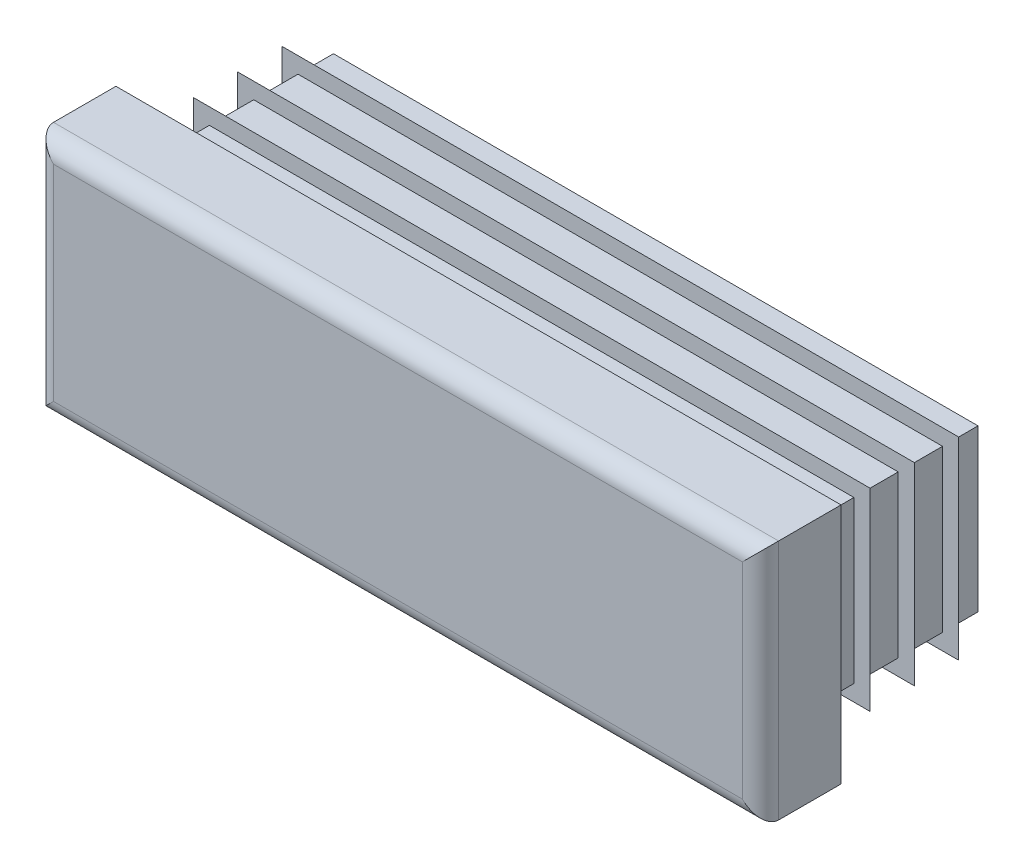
ISO-10303-21;
HEADER;
FILE_DESCRIPTION(('STEP AP214'),'2;1');
FILE_NAME('part.step','',(''),(''),'','','');
FILE_SCHEMA(('AUTOMOTIVE_DESIGN { 1 0 10303 214 1 1 1 1 }'));
ENDSEC;
DATA;
#1=APPLICATION_CONTEXT('core data for automotive mechanical design processes');
#2=APPLICATION_PROTOCOL_DEFINITION('international standard','automotive_design',2000,#1);
#3=PRODUCT_CONTEXT('',#1,'mechanical');
#4=PRODUCT('Part','Part','',(#3));
#5=PRODUCT_RELATED_PRODUCT_CATEGORY('part','',(#4));
#6=PRODUCT_DEFINITION_FORMATION('','',#4);
#7=PRODUCT_DEFINITION_CONTEXT('part definition',#1,'design');
#8=PRODUCT_DEFINITION('design','',#6,#7);
#9=PRODUCT_DEFINITION_SHAPE('','',#8);
#10=(LENGTH_UNIT() NAMED_UNIT(*) SI_UNIT(.MILLI.,.METRE.));
#11=(NAMED_UNIT(*) PLANE_ANGLE_UNIT() SI_UNIT($,.RADIAN.));
#12=(NAMED_UNIT(*) SI_UNIT($,.STERADIAN.) SOLID_ANGLE_UNIT());
#13=UNCERTAINTY_MEASURE_WITH_UNIT(LENGTH_MEASURE(1.E-05),#10,'distance_accuracy_value','');
#14=(GEOMETRIC_REPRESENTATION_CONTEXT(3) GLOBAL_UNCERTAINTY_ASSIGNED_CONTEXT((#13)) GLOBAL_UNIT_ASSIGNED_CONTEXT((#10,
#11,#12)) REPRESENTATION_CONTEXT('',''));
#15=CARTESIAN_POINT('',(0.,0.,0.));
#16=DIRECTION('',(0.,0.,1.));
#17=DIRECTION('',(1.,0.,0.));
#18=AXIS2_PLACEMENT_3D('',#15,#16,#17);
#19=CARTESIAN_POINT('',(21.375,-7.5,5.));
#20=DIRECTION('',(0.,0.,-1.));
#21=DIRECTION('',(0.,1.,0.));
#22=AXIS2_PLACEMENT_3D('',#19,#20,#21);
#23=PLANE('',#22);
#24=DIRECTION('',(0.,1.,0.));
#25=VECTOR('',#24,1.);
#26=CARTESIAN_POINT('',(-21.375,-7.5,5.));
#27=LINE('',#26,#25);
#28=CARTESIAN_POINT('',(-21.375,-6.375,5.));
#29=VERTEX_POINT('',#28);
#30=CARTESIAN_POINT('',(-21.375,6.375,5.));
#31=VERTEX_POINT('',#30);
#32=EDGE_CURVE('E310',#29,#31,#27,.T.);
#33=ORIENTED_EDGE('',*,*,#32,.F.);
#34=DIRECTION('',(-1.,0.,0.));
#35=VECTOR('',#34,1.);
#36=CARTESIAN_POINT('',(22.5,-6.375,5.));
#37=LINE('',#36,#35);
#38=CARTESIAN_POINT('',(21.375,-6.375,5.));
#39=VERTEX_POINT('',#38);
#40=EDGE_CURVE('E482',#39,#29,#37,.T.);
#41=ORIENTED_EDGE('',*,*,#40,.F.);
#42=DIRECTION('',(0.,1.,0.));
#43=VECTOR('',#42,1.);
#44=CARTESIAN_POINT('',(21.375,-7.5,5.));
#45=LINE('',#44,#43);
#46=CARTESIAN_POINT('',(21.375,6.375,5.));
#47=VERTEX_POINT('',#46);
#48=EDGE_CURVE('E305',#39,#47,#45,.T.);
#49=ORIENTED_EDGE('',*,*,#48,.T.);
#50=DIRECTION('',(-1.,0.,0.));
#51=VECTOR('',#50,1.);
#52=CARTESIAN_POINT('',(22.5,6.375,5.));
#53=LINE('',#52,#51);
#54=EDGE_CURVE('E630',#47,#31,#53,.T.);
#55=ORIENTED_EDGE('',*,*,#54,.T.);
#56=EDGE_LOOP('',(#33,#41,#49,#55));
#57=FACE_BOUND('',#56,.T.);
#58=ADVANCED_FACE('F14',(#57),#23,.F.);
#59=CARTESIAN_POINT('',(-21.375,-7.5,3.875));
#60=DIRECTION('',(0.,1.,0.));
#61=DIRECTION('',(-1.,0.,0.));
#62=AXIS2_PLACEMENT_3D('',#59,#60,#61);
#63=CYLINDRICAL_SURFACE('',#62,1.125);
#64=DIRECTION('',(0.,1.,0.));
#65=VECTOR('',#64,1.);
#66=CARTESIAN_POINT('',(-22.5,-7.5,3.875));
#67=LINE('',#66,#65);
#68=CARTESIAN_POINT('',(-22.5,-7.5,3.875));
#69=VERTEX_POINT('',#68);
#70=CARTESIAN_POINT('',(-22.5,7.5,3.875));
#71=VERTEX_POINT('',#70);
#72=EDGE_CURVE('E402',#69,#71,#67,.T.);
#73=ORIENTED_EDGE('',*,*,#72,.F.);
#74=CARTESIAN_POINT('',(-21.375,-6.375,3.875));
#75=DIRECTION('',(-0.707106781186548,0.707106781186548,0.));
#76=DIRECTION('',(0.707106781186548,0.707106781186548,0.));
#77=AXIS2_PLACEMENT_3D('',#74,#75,#76);
#78=ELLIPSE('',#77,1.59099025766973,1.125);
#79=EDGE_CURVE('E59',#69,#29,#78,.T.);
#80=ORIENTED_EDGE('',*,*,#79,.T.);
#81=ORIENTED_EDGE('',*,*,#32,.T.);
#82=CARTESIAN_POINT('',(-21.375,6.375,3.875));
#83=DIRECTION('',(0.707106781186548,0.707106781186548,0.));
#84=DIRECTION('',(-0.707106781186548,0.707106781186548,0.));
#85=AXIS2_PLACEMENT_3D('',#82,#83,#84);
#86=ELLIPSE('',#85,1.59099025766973,1.125);
#87=EDGE_CURVE('E306',#31,#71,#86,.F.);
#88=ORIENTED_EDGE('',*,*,#87,.T.);
#89=EDGE_LOOP('',(#73,#80,#81,#88));
#90=FACE_BOUND('',#89,.T.);
#91=ADVANCED_FACE('F16',(#90),#63,.T.);
#92=CARTESIAN_POINT('',(-22.5,-7.5,3.875));
#93=DIRECTION('',(1.,0.,0.));
#94=DIRECTION('',(0.,1.,0.));
#95=AXIS2_PLACEMENT_3D('',#92,#93,#94);
#96=PLANE('',#95);
#97=DIRECTION('',(0.,0.,-1.));
#98=VECTOR('',#97,1.);
#99=CARTESIAN_POINT('',(-22.5,7.5,3.875));
#100=LINE('',#99,#98);
#101=CARTESIAN_POINT('',(-22.5,7.5,0.));
#102=VERTEX_POINT('',#101);
#103=EDGE_CURVE('E615',#71,#102,#100,.T.);
#104=ORIENTED_EDGE('',*,*,#103,.T.);
#105=DIRECTION('',(0.,1.,0.));
#106=VECTOR('',#105,1.);
#107=CARTESIAN_POINT('',(-22.5,-7.5,0.));
#108=LINE('',#107,#106);
#109=CARTESIAN_POINT('',(-22.5,-7.5,0.));
#110=VERTEX_POINT('',#109);
#111=EDGE_CURVE('E400',#110,#102,#108,.T.);
#112=ORIENTED_EDGE('',*,*,#111,.F.);
#113=DIRECTION('',(0.,0.,-1.));
#114=VECTOR('',#113,1.);
#115=CARTESIAN_POINT('',(-22.5,-7.5,3.875));
#116=LINE('',#115,#114);
#117=EDGE_CURVE('E616',#69,#110,#116,.T.);
#118=ORIENTED_EDGE('',*,*,#117,.F.);
#119=ORIENTED_EDGE('',*,*,#72,.T.);
#120=EDGE_LOOP('',(#104,#112,#118,#119));
#121=FACE_BOUND('',#120,.T.);
#122=ADVANCED_FACE('F697',(#121),#96,.F.);
#123=CARTESIAN_POINT('',(-20.,-7.5,0.));
#124=DIRECTION('',(1.,0.,0.));
#125=DIRECTION('',(0.,1.,0.));
#126=AXIS2_PLACEMENT_3D('',#123,#124,#125);
#127=PLANE('',#126);
#128=DIRECTION('',(0.,1.,0.));
#129=VECTOR('',#128,1.);
#130=CARTESIAN_POINT('',(-20.,-7.5,0.));
#131=LINE('',#130,#129);
#132=CARTESIAN_POINT('',(-20.,-5.,0.));
#133=VERTEX_POINT('',#132);
#134=CARTESIAN_POINT('',(-20.,5.,0.));
#135=VERTEX_POINT('',#134);
#136=EDGE_CURVE('E397',#133,#135,#131,.T.);
#137=ORIENTED_EDGE('',*,*,#136,.T.);
#138=DIRECTION('',(0.,0.,-1.));
#139=VECTOR('',#138,1.);
#140=CARTESIAN_POINT('',(-20.,5.,0.));
#141=LINE('',#140,#139);
#142=CARTESIAN_POINT('',(-20.,5.,-0.55));
#143=VERTEX_POINT('',#142);
#144=EDGE_CURVE('E495',#135,#143,#141,.T.);
#145=ORIENTED_EDGE('',*,*,#144,.T.);
#146=DIRECTION('',(0.,1.,0.));
#147=VECTOR('',#146,1.);
#148=CARTESIAN_POINT('',(-20.,-7.5,-0.55));
#149=LINE('',#148,#147);
#150=CARTESIAN_POINT('',(-20.,-5.,-0.55));
#151=VERTEX_POINT('',#150);
#152=EDGE_CURVE('E394',#151,#143,#149,.T.);
#153=ORIENTED_EDGE('',*,*,#152,.F.);
#154=DIRECTION('',(0.,0.,1.));
#155=VECTOR('',#154,1.);
#156=CARTESIAN_POINT('',(-20.,-5.,0.));
#157=LINE('',#156,#155);
#158=EDGE_CURVE('E489',#151,#133,#157,.T.);
#159=ORIENTED_EDGE('',*,*,#158,.T.);
#160=EDGE_LOOP('',(#137,#145,#153,#159));
#161=FACE_BOUND('',#160,.T.);
#162=ADVANCED_FACE('F787',(#161),#127,.F.);
#163=CARTESIAN_POINT('',(-21.,-7.5,-0.55));
#164=DIRECTION('',(0.342020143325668,0.,0.939692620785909));
#165=DIRECTION('',(-0.939692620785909,0.,0.342020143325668));
#166=AXIS2_PLACEMENT_3D('',#163,#164,#165);
#167=PLANE('',#166);
#168=DIRECTION('',(0.,1.,0.));
#169=VECTOR('',#168,1.);
#170=CARTESIAN_POINT('',(-21.,-7.5,-0.55));
#171=LINE('',#170,#169);
#172=CARTESIAN_POINT('',(-21.,-6.,-0.55));
#173=VERTEX_POINT('',#172);
#174=CARTESIAN_POINT('',(-21.,6.,-0.550000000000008));
#175=VERTEX_POINT('',#174);
#176=EDGE_CURVE('E392',#173,#175,#171,.T.);
#177=ORIENTED_EDGE('',*,*,#176,.T.);
#178=DIRECTION('',(0.844349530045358,-0.43889572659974,-0.307318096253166));
#179=VECTOR('',#178,1.);
#180=CARTESIAN_POINT('',(-15.997151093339,3.39950230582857,-2.37088808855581));
#181=LINE('',#180,#179);
#182=CARTESIAN_POINT('',(-20.,5.48019663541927,-0.913970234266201));
#183=VERTEX_POINT('',#182);
#184=EDGE_CURVE('E519',#175,#183,#181,.T.);
#185=ORIENTED_EDGE('',*,*,#184,.T.);
#186=DIRECTION('',(0.,1.,0.));
#187=VECTOR('',#186,1.);
#188=CARTESIAN_POINT('',(-20.,-7.5,-0.913970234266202));
#189=LINE('',#188,#187);
#190=CARTESIAN_POINT('',(-20.,-5.48019663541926,-0.913970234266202));
#191=VERTEX_POINT('',#190);
#192=EDGE_CURVE('E389',#191,#183,#189,.T.);
#193=ORIENTED_EDGE('',*,*,#192,.F.);
#194=DIRECTION('',(-0.844349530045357,-0.43889572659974,0.307318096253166));
#195=VECTOR('',#194,1.);
#196=CARTESIAN_POINT('',(-21.5558721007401,-6.28894418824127,-0.347679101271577));
#197=LINE('',#196,#195);
#198=EDGE_CURVE('E507',#191,#173,#197,.T.);
#199=ORIENTED_EDGE('',*,*,#198,.T.);
#200=EDGE_LOOP('',(#177,#185,#193,#199));
#201=FACE_BOUND('',#200,.T.);
#202=ADVANCED_FACE('F783',(#201),#167,.F.);
#203=CARTESIAN_POINT('',(-20.,-7.5,-0.913970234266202));
#204=DIRECTION('',(1.,0.,0.));
#205=DIRECTION('',(0.,1.,0.));
#206=AXIS2_PLACEMENT_3D('',#203,#204,#205);
#207=PLANE('',#206);
#208=ORIENTED_EDGE('',*,*,#192,.T.);
#209=DIRECTION('',(0.,-0.819152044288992,-0.573576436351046));
#210=VECTOR('',#209,1.);
#211=CARTESIAN_POINT('',(-20.,-3.2296460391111,-7.01266773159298));
#212=LINE('',#211,#210);
#213=CARTESIAN_POINT('',(-20.,5.,-1.25020753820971));
#214=VERTEX_POINT('',#213);
#215=EDGE_CURVE('E516',#183,#214,#212,.T.);
#216=ORIENTED_EDGE('',*,*,#215,.T.);
#217=DIRECTION('',(0.,0.,-1.));
#218=VECTOR('',#217,1.);
#219=CARTESIAN_POINT('',(-20.,5.,-0.913970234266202));
#220=LINE('',#219,#218);
#221=CARTESIAN_POINT('',(-20.,5.,-3.3));
#222=VERTEX_POINT('',#221);
#223=EDGE_CURVE('E525',#214,#222,#220,.T.);
#224=ORIENTED_EDGE('',*,*,#223,.T.);
#225=DIRECTION('',(0.,1.,0.));
#226=VECTOR('',#225,1.);
#227=CARTESIAN_POINT('',(-20.,-7.5,-3.3));
#228=LINE('',#227,#226);
#229=CARTESIAN_POINT('',(-20.,-5.,-3.3));
#230=VERTEX_POINT('',#229);
#231=EDGE_CURVE('E386',#230,#222,#228,.T.);
#232=ORIENTED_EDGE('',*,*,#231,.F.);
#233=DIRECTION('',(0.,0.,1.));
#234=VECTOR('',#233,1.);
#235=CARTESIAN_POINT('',(-20.,-5.,-0.913970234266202));
#236=LINE('',#235,#234);
#237=CARTESIAN_POINT('',(-20.,-5.,-1.25020753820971));
#238=VERTEX_POINT('',#237);
#239=EDGE_CURVE('E522',#230,#238,#236,.T.);
#240=ORIENTED_EDGE('',*,*,#239,.T.);
#241=DIRECTION('',(0.,-0.819152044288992,0.573576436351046));
#242=VECTOR('',#241,1.);
#243=CARTESIAN_POINT('',(-20.,-6.83550503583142,0.0350269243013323));
#244=LINE('',#243,#242);
#245=EDGE_CURVE('E504',#238,#191,#244,.T.);
#246=ORIENTED_EDGE('',*,*,#245,.T.);
#247=EDGE_LOOP('',(#208,#216,#224,#232,#240,#246));
#248=FACE_BOUND('',#247,.T.);
#249=ADVANCED_FACE('F779',(#248),#207,.F.);
#250=CARTESIAN_POINT('',(-21.,-7.5,-3.3));
#251=DIRECTION('',(0.342020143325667,0.,0.939692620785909));
#252=DIRECTION('',(-0.939692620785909,0.,0.342020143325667));
#253=AXIS2_PLACEMENT_3D('',#250,#251,#252);
#254=PLANE('',#253);
#255=DIRECTION('',(0.,1.,0.));
#256=VECTOR('',#255,1.);
#257=CARTESIAN_POINT('',(-21.,-7.5,-3.3));
#258=LINE('',#257,#256);
#259=CARTESIAN_POINT('',(-21.,-6.,-3.3));
#260=VERTEX_POINT('',#259);
#261=CARTESIAN_POINT('',(-21.,6.,-3.3));
#262=VERTEX_POINT('',#261);
#263=EDGE_CURVE('E384',#260,#262,#258,.T.);
#264=ORIENTED_EDGE('',*,*,#263,.T.);
#265=DIRECTION('',(0.844349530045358,-0.43889572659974,-0.307318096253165));
#266=VECTOR('',#265,1.);
#267=CARTESIAN_POINT('',(-15.997151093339,3.39950230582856,-5.12088808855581));
#268=LINE('',#267,#266);
#269=CARTESIAN_POINT('',(-20.,5.48019663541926,-3.66397023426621));
#270=VERTEX_POINT('',#269);
#271=EDGE_CURVE('E549',#262,#270,#268,.T.);
#272=ORIENTED_EDGE('',*,*,#271,.T.);
#273=DIRECTION('',(0.,1.,0.));
#274=VECTOR('',#273,1.);
#275=CARTESIAN_POINT('',(-20.,-7.5,-3.66397023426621));
#276=LINE('',#275,#274);
#277=CARTESIAN_POINT('',(-20.,-5.48019663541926,-3.66397023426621));
#278=VERTEX_POINT('',#277);
#279=EDGE_CURVE('E381',#278,#270,#276,.T.);
#280=ORIENTED_EDGE('',*,*,#279,.F.);
#281=DIRECTION('',(-0.844349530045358,-0.43889572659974,0.307318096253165));
#282=VECTOR('',#281,1.);
#283=CARTESIAN_POINT('',(-21.5558721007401,-6.28894418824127,-3.09767910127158));
#284=LINE('',#283,#282);
#285=EDGE_CURVE('E537',#278,#260,#284,.T.);
#286=ORIENTED_EDGE('',*,*,#285,.T.);
#287=EDGE_LOOP('',(#264,#272,#280,#286));
#288=FACE_BOUND('',#287,.T.);
#289=ADVANCED_FACE('F775',(#288),#254,.F.);
#290=CARTESIAN_POINT('',(-20.,-7.5,-3.66397023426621));
#291=DIRECTION('',(1.,0.,0.));
#292=DIRECTION('',(0.,1.,0.));
#293=AXIS2_PLACEMENT_3D('',#290,#291,#292);
#294=PLANE('',#293);
#295=ORIENTED_EDGE('',*,*,#279,.T.);
#296=DIRECTION('',(0.,-0.819152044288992,-0.573576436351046));
#297=VECTOR('',#296,1.);
#298=CARTESIAN_POINT('',(-20.,-3.22964603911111,-9.76266773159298));
#299=LINE('',#298,#297);
#300=CARTESIAN_POINT('',(-20.,5.,-4.00020753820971));
#301=VERTEX_POINT('',#300);
#302=EDGE_CURVE('E546',#270,#301,#299,.T.);
#303=ORIENTED_EDGE('',*,*,#302,.T.);
#304=DIRECTION('',(0.,0.,-1.));
#305=VECTOR('',#304,1.);
#306=CARTESIAN_POINT('',(-20.,5.,-3.66397023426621));
#307=LINE('',#306,#305);
#308=CARTESIAN_POINT('',(-20.,5.,-6.05));
#309=VERTEX_POINT('',#308);
#310=EDGE_CURVE('E555',#301,#309,#307,.T.);
#311=ORIENTED_EDGE('',*,*,#310,.T.);
#312=DIRECTION('',(0.,1.,0.));
#313=VECTOR('',#312,1.);
#314=CARTESIAN_POINT('',(-20.,-7.5,-6.05));
#315=LINE('',#314,#313);
#316=CARTESIAN_POINT('',(-20.,-5.,-6.05));
#317=VERTEX_POINT('',#316);
#318=EDGE_CURVE('E378',#317,#309,#315,.T.);
#319=ORIENTED_EDGE('',*,*,#318,.F.);
#320=DIRECTION('',(0.,0.,1.));
#321=VECTOR('',#320,1.);
#322=CARTESIAN_POINT('',(-20.,-5.,-3.66397023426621));
#323=LINE('',#322,#321);
#324=CARTESIAN_POINT('',(-20.,-5.,-4.00020753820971));
#325=VERTEX_POINT('',#324);
#326=EDGE_CURVE('E552',#317,#325,#323,.T.);
#327=ORIENTED_EDGE('',*,*,#326,.T.);
#328=DIRECTION('',(0.,-0.819152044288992,0.573576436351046));
#329=VECTOR('',#328,1.);
#330=CARTESIAN_POINT('',(-20.,-6.83550503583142,-2.71497307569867));
#331=LINE('',#330,#329);
#332=EDGE_CURVE('E534',#325,#278,#331,.T.);
#333=ORIENTED_EDGE('',*,*,#332,.T.);
#334=EDGE_LOOP('',(#295,#303,#311,#319,#327,#333));
#335=FACE_BOUND('',#334,.T.);
#336=ADVANCED_FACE('F771',(#335),#294,.F.);
#337=CARTESIAN_POINT('',(-21.,-7.5,-6.05));
#338=DIRECTION('',(0.342020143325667,0.,0.939692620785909));
#339=DIRECTION('',(-0.939692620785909,0.,0.342020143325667));
#340=AXIS2_PLACEMENT_3D('',#337,#338,#339);
#341=PLANE('',#340);
#342=DIRECTION('',(0.,1.,0.));
#343=VECTOR('',#342,1.);
#344=CARTESIAN_POINT('',(-21.,-7.5,-6.05));
#345=LINE('',#344,#343);
#346=CARTESIAN_POINT('',(-21.,-6.,-6.05));
#347=VERTEX_POINT('',#346);
#348=CARTESIAN_POINT('',(-21.,6.,-6.05));
#349=VERTEX_POINT('',#348);
#350=EDGE_CURVE('E376',#347,#349,#345,.T.);
#351=ORIENTED_EDGE('',*,*,#350,.T.);
#352=DIRECTION('',(0.844349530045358,-0.43889572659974,-0.307318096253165));
#353=VECTOR('',#352,1.);
#354=CARTESIAN_POINT('',(-15.9971510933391,3.39950230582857,-7.87088808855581));
#355=LINE('',#354,#353);
#356=CARTESIAN_POINT('',(-20.,5.48019663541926,-6.4139702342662));
#357=VERTEX_POINT('',#356);
#358=EDGE_CURVE('E579',#349,#357,#355,.T.);
#359=ORIENTED_EDGE('',*,*,#358,.T.);
#360=DIRECTION('',(0.,1.,0.));
#361=VECTOR('',#360,1.);
#362=CARTESIAN_POINT('',(-20.,-7.5,-6.4139702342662));
#363=LINE('',#362,#361);
#364=CARTESIAN_POINT('',(-20.,-5.48019663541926,-6.4139702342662));
#365=VERTEX_POINT('',#364);
#366=EDGE_CURVE('E373',#365,#357,#363,.T.);
#367=ORIENTED_EDGE('',*,*,#366,.F.);
#368=DIRECTION('',(-0.844349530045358,-0.43889572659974,0.307318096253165));
#369=VECTOR('',#368,1.);
#370=CARTESIAN_POINT('',(-21.5558721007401,-6.28894418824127,-5.84767910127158));
#371=LINE('',#370,#369);
#372=EDGE_CURVE('E567',#365,#347,#371,.T.);
#373=ORIENTED_EDGE('',*,*,#372,.T.);
#374=EDGE_LOOP('',(#351,#359,#367,#373));
#375=FACE_BOUND('',#374,.T.);
#376=ADVANCED_FACE('F767',(#375),#341,.F.);
#377=CARTESIAN_POINT('',(-20.,-7.5,-6.4139702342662));
#378=DIRECTION('',(1.,0.,0.));
#379=DIRECTION('',(0.,1.,0.));
#380=AXIS2_PLACEMENT_3D('',#377,#378,#379);
#381=PLANE('',#380);
#382=ORIENTED_EDGE('',*,*,#366,.T.);
#383=DIRECTION('',(0.,-0.819152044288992,-0.573576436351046));
#384=VECTOR('',#383,1.);
#385=CARTESIAN_POINT('',(-20.,-3.2296460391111,-12.512667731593));
#386=LINE('',#385,#384);
#387=CARTESIAN_POINT('',(-20.,5.,-6.75020753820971));
#388=VERTEX_POINT('',#387);
#389=EDGE_CURVE('E576',#357,#388,#386,.T.);
#390=ORIENTED_EDGE('',*,*,#389,.T.);
#391=DIRECTION('',(0.,0.,-1.));
#392=VECTOR('',#391,1.);
#393=CARTESIAN_POINT('',(-20.,5.,-6.4139702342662));
#394=LINE('',#393,#392);
#395=CARTESIAN_POINT('',(-20.,5.,-8.8));
#396=VERTEX_POINT('',#395);
#397=EDGE_CURVE('E585',#388,#396,#394,.T.);
#398=ORIENTED_EDGE('',*,*,#397,.T.);
#399=DIRECTION('',(0.,1.,0.));
#400=VECTOR('',#399,1.);
#401=CARTESIAN_POINT('',(-20.,-7.5,-8.8));
#402=LINE('',#401,#400);
#403=CARTESIAN_POINT('',(-20.,-5.,-8.8));
#404=VERTEX_POINT('',#403);
#405=EDGE_CURVE('E370',#404,#396,#402,.T.);
#406=ORIENTED_EDGE('',*,*,#405,.F.);
#407=DIRECTION('',(0.,0.,1.));
#408=VECTOR('',#407,1.);
#409=CARTESIAN_POINT('',(-20.,-5.,-6.4139702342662));
#410=LINE('',#409,#408);
#411=CARTESIAN_POINT('',(-20.,-5.,-6.75020753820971));
#412=VERTEX_POINT('',#411);
#413=EDGE_CURVE('E582',#404,#412,#410,.T.);
#414=ORIENTED_EDGE('',*,*,#413,.T.);
#415=DIRECTION('',(0.,-0.819152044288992,0.573576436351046));
#416=VECTOR('',#415,1.);
#417=CARTESIAN_POINT('',(-20.,-6.83550503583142,-5.46497307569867));
#418=LINE('',#417,#416);
#419=EDGE_CURVE('E564',#412,#365,#418,.T.);
#420=ORIENTED_EDGE('',*,*,#419,.T.);
#421=EDGE_LOOP('',(#382,#390,#398,#406,#414,#420));
#422=FACE_BOUND('',#421,.T.);
#423=ADVANCED_FACE('F764',(#422),#381,.F.);
#424=CARTESIAN_POINT('',(-21.,-7.5,-8.8));
#425=DIRECTION('',(0.342020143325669,0.,0.939692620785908));
#426=DIRECTION('',(-0.939692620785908,0.,0.342020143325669));
#427=AXIS2_PLACEMENT_3D('',#424,#425,#426);
#428=PLANE('',#427);
#429=DIRECTION('',(0.,1.,0.));
#430=VECTOR('',#429,1.);
#431=CARTESIAN_POINT('',(-21.,-7.5,-8.8));
#432=LINE('',#431,#430);
#433=CARTESIAN_POINT('',(-21.,-6.,-8.8));
#434=VERTEX_POINT('',#433);
#435=CARTESIAN_POINT('',(-21.,6.,-8.8));
#436=VERTEX_POINT('',#435);
#437=EDGE_CURVE('E368',#434,#436,#432,.T.);
#438=ORIENTED_EDGE('',*,*,#437,.T.);
#439=DIRECTION('',(0.844349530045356,-0.438895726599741,-0.307318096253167));
#440=VECTOR('',#439,1.);
#441=CARTESIAN_POINT('',(-15.997151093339,3.39950230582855,-10.6208880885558));
#442=LINE('',#441,#440);
#443=CARTESIAN_POINT('',(-20.,5.48019663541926,-9.1639702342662));
#444=VERTEX_POINT('',#443);
#445=EDGE_CURVE('E607',#436,#444,#442,.T.);
#446=ORIENTED_EDGE('',*,*,#445,.T.);
#447=DIRECTION('',(0.,1.,0.));
#448=VECTOR('',#447,1.);
#449=CARTESIAN_POINT('',(-20.,-7.5,-9.1639702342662));
#450=LINE('',#449,#448);
#451=CARTESIAN_POINT('',(-20.,-5.48019663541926,-9.1639702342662));
#452=VERTEX_POINT('',#451);
#453=EDGE_CURVE('E365',#452,#444,#450,.T.);
#454=ORIENTED_EDGE('',*,*,#453,.F.);
#455=DIRECTION('',(-0.844349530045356,-0.438895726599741,0.307318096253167));
#456=VECTOR('',#455,1.);
#457=CARTESIAN_POINT('',(-21.5558721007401,-6.28894418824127,-8.59767910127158));
#458=LINE('',#457,#456);
#459=EDGE_CURVE('E595',#452,#434,#458,.T.);
#460=ORIENTED_EDGE('',*,*,#459,.T.);
#461=EDGE_LOOP('',(#438,#446,#454,#460));
#462=FACE_BOUND('',#461,.T.);
#463=ADVANCED_FACE('F675',(#462),#428,.F.);
#464=CARTESIAN_POINT('',(-20.,-7.5,-9.1639702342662));
#465=DIRECTION('',(1.,0.,0.));
#466=DIRECTION('',(0.,1.,0.));
#467=AXIS2_PLACEMENT_3D('',#464,#465,#466);
#468=PLANE('',#467);
#469=ORIENTED_EDGE('',*,*,#453,.T.);
#470=DIRECTION('',(0.,-0.819152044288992,-0.573576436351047));
#471=VECTOR('',#470,1.);
#472=CARTESIAN_POINT('',(-20.,-3.22964603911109,-15.262667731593));
#473=LINE('',#472,#471);
#474=CARTESIAN_POINT('',(-20.,5.,-9.50020753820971));
#475=VERTEX_POINT('',#474);
#476=EDGE_CURVE('E604',#444,#475,#473,.T.);
#477=ORIENTED_EDGE('',*,*,#476,.T.);
#478=DIRECTION('',(0.,0.,-1.));
#479=VECTOR('',#478,1.);
#480=CARTESIAN_POINT('',(-20.,5.,-9.1639702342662));
#481=LINE('',#480,#479);
#482=CARTESIAN_POINT('',(-20.,5.,-11.));
#483=VERTEX_POINT('',#482);
#484=EDGE_CURVE('E613',#475,#483,#481,.T.);
#485=ORIENTED_EDGE('',*,*,#484,.T.);
#486=DIRECTION('',(0.,1.,0.));
#487=VECTOR('',#486,1.);
#488=CARTESIAN_POINT('',(-20.,-7.5,-11.));
#489=LINE('',#488,#487);
#490=CARTESIAN_POINT('',(-20.,-5.,-11.));
#491=VERTEX_POINT('',#490);
#492=EDGE_CURVE('E362',#491,#483,#489,.T.);
#493=ORIENTED_EDGE('',*,*,#492,.F.);
#494=DIRECTION('',(0.,0.,1.));
#495=VECTOR('',#494,1.);
#496=CARTESIAN_POINT('',(-20.,-5.,-9.1639702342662));
#497=LINE('',#496,#495);
#498=CARTESIAN_POINT('',(-20.,-5.,-9.50020753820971));
#499=VERTEX_POINT('',#498);
#500=EDGE_CURVE('E610',#491,#499,#497,.T.);
#501=ORIENTED_EDGE('',*,*,#500,.T.);
#502=DIRECTION('',(0.,-0.819152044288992,0.573576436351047));
#503=VECTOR('',#502,1.);
#504=CARTESIAN_POINT('',(-20.,-6.83550503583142,-8.21497307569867));
#505=LINE('',#504,#503);
#506=EDGE_CURVE('E592',#499,#452,#505,.T.);
#507=ORIENTED_EDGE('',*,*,#506,.T.);
#508=EDGE_LOOP('',(#469,#477,#485,#493,#501,#507));
#509=FACE_BOUND('',#508,.T.);
#510=ADVANCED_FACE('F677',(#509),#468,.F.);
#511=CARTESIAN_POINT('',(-20.,-7.5,-11.));
#512=DIRECTION('',(0.,0.,1.));
#513=DIRECTION('',(0.,-1.,0.));
#514=AXIS2_PLACEMENT_3D('',#511,#512,#513);
#515=PLANE('',#514);
#516=ORIENTED_EDGE('',*,*,#492,.T.);
#517=DIRECTION('',(-1.,0.,0.));
#518=VECTOR('',#517,1.);
#519=CARTESIAN_POINT('',(22.5,5.,-11.));
#520=LINE('',#519,#518);
#521=CARTESIAN_POINT('',(20.,5.,-11.));
#522=VERTEX_POINT('',#521);
#523=EDGE_CURVE('E438',#522,#483,#520,.T.);
#524=ORIENTED_EDGE('',*,*,#523,.F.);
#525=DIRECTION('',(0.,1.,0.));
#526=VECTOR('',#525,1.);
#527=CARTESIAN_POINT('',(20.,-7.5,-11.));
#528=LINE('',#527,#526);
#529=CARTESIAN_POINT('',(20.,-5.,-11.));
#530=VERTEX_POINT('',#529);
#531=EDGE_CURVE('E359',#530,#522,#528,.T.);
#532=ORIENTED_EDGE('',*,*,#531,.F.);
#533=DIRECTION('',(-1.,0.,0.));
#534=VECTOR('',#533,1.);
#535=CARTESIAN_POINT('',(22.5,-5.,-11.));
#536=LINE('',#535,#534);
#537=EDGE_CURVE('E436',#530,#491,#536,.T.);
#538=ORIENTED_EDGE('',*,*,#537,.T.);
#539=EDGE_LOOP('',(#516,#524,#532,#538));
#540=FACE_BOUND('',#539,.T.);
#541=ADVANCED_FACE('F435',(#540),#515,.F.);
#542=CARTESIAN_POINT('',(20.,-7.5,-11.));
#543=DIRECTION('',(-1.,0.,0.));
#544=DIRECTION('',(0.,-1.,0.));
#545=AXIS2_PLACEMENT_3D('',#542,#543,#544);
#546=PLANE('',#545);
#547=DIRECTION('',(0.,0.,1.));
#548=VECTOR('',#547,1.);
#549=CARTESIAN_POINT('',(20.,5.,-11.));
#550=LINE('',#549,#548);
#551=CARTESIAN_POINT('',(20.,5.,-9.50020753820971));
#552=VERTEX_POINT('',#551);
#553=EDGE_CURVE('E9',#522,#552,#550,.T.);
#554=ORIENTED_EDGE('',*,*,#553,.T.);
#555=DIRECTION('',(0.,0.819152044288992,0.573576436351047));
#556=VECTOR('',#555,1.);
#557=CARTESIAN_POINT('',(20.,-4.09229785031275,-15.8667030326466));
#558=LINE('',#557,#556);
#559=CARTESIAN_POINT('',(20.,5.48019663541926,-9.1639702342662));
#560=VERTEX_POINT('',#559);
#561=EDGE_CURVE('E601',#552,#560,#558,.T.);
#562=ORIENTED_EDGE('',*,*,#561,.T.);
#563=DIRECTION('',(0.,1.,0.));
#564=VECTOR('',#563,1.);
#565=CARTESIAN_POINT('',(20.,-7.5,-9.1639702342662));
#566=LINE('',#565,#564);
#567=CARTESIAN_POINT('',(20.,-5.48019663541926,-9.1639702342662));
#568=VERTEX_POINT('',#567);
#569=EDGE_CURVE('E356',#568,#560,#566,.T.);
#570=ORIENTED_EDGE('',*,*,#569,.F.);
#571=DIRECTION('',(0.,0.819152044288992,-0.573576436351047));
#572=VECTOR('',#571,1.);
#573=CARTESIAN_POINT('',(20.,-5.97285322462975,-8.81900837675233));
#574=LINE('',#573,#572);
#575=CARTESIAN_POINT('',(20.,-5.,-9.50020753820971));
#576=VERTEX_POINT('',#575);
#577=EDGE_CURVE('E428',#568,#576,#574,.T.);
#578=ORIENTED_EDGE('',*,*,#577,.T.);
#579=DIRECTION('',(0.,0.,-1.));
#580=VECTOR('',#579,1.);
#581=CARTESIAN_POINT('',(20.,-5.,-11.));
#582=LINE('',#581,#580);
#583=EDGE_CURVE('E23',#576,#530,#582,.T.);
#584=ORIENTED_EDGE('',*,*,#583,.T.);
#585=ORIENTED_EDGE('',*,*,#531,.T.);
#586=EDGE_LOOP('',(#554,#562,#570,#578,#584,#585));
#587=FACE_BOUND('',#586,.T.);
#588=ADVANCED_FACE('F426',(#587),#546,.F.);
#589=CARTESIAN_POINT('',(20.,-7.5,-9.1639702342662));
#590=DIRECTION('',(-0.342020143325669,0.,0.939692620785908));
#591=DIRECTION('',(-0.939692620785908,0.,-0.342020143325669));
#592=AXIS2_PLACEMENT_3D('',#589,#590,#591);
#593=PLANE('',#592);
#594=ORIENTED_EDGE('',*,*,#569,.T.);
#595=DIRECTION('',(0.844349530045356,0.438895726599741,0.307318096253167));
#596=VECTOR('',#595,1.);
#597=CARTESIAN_POINT('',(15.1897805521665,2.97982838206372,-10.914746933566));
#598=LINE('',#597,#596);
#599=CARTESIAN_POINT('',(21.,6.,-8.8));
#600=VERTEX_POINT('',#599);
#601=EDGE_CURVE('E598',#560,#600,#598,.T.);
#602=ORIENTED_EDGE('',*,*,#601,.T.);
#603=DIRECTION('',(0.,1.,0.));
#604=VECTOR('',#603,1.);
#605=CARTESIAN_POINT('',(21.,-7.5,-8.8));
#606=LINE('',#605,#604);
#607=CARTESIAN_POINT('',(21.,-6.,-8.8));
#608=VERTEX_POINT('',#607);
#609=EDGE_CURVE('E353',#608,#600,#606,.T.);
#610=ORIENTED_EDGE('',*,*,#609,.F.);
#611=DIRECTION('',(-0.844349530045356,0.438895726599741,-0.307318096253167));
#612=VECTOR('',#611,1.);
#613=CARTESIAN_POINT('',(20.7485015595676,-5.86927026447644,-8.89153794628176));
#614=LINE('',#613,#612);
#615=EDGE_CURVE('E588',#608,#568,#614,.T.);
#616=ORIENTED_EDGE('',*,*,#615,.T.);
#617=EDGE_LOOP('',(#594,#602,#610,#616));
#618=FACE_BOUND('',#617,.T.);
#619=ADVANCED_FACE('F752',(#618),#593,.F.);
#620=CARTESIAN_POINT('',(21.,-7.5,-8.8));
#621=DIRECTION('',(0.,0.,-1.));
#622=DIRECTION('',(0.,1.,0.));
#623=AXIS2_PLACEMENT_3D('',#620,#621,#622);
#624=PLANE('',#623);
#625=ORIENTED_EDGE('',*,*,#609,.T.);
#626=DIRECTION('',(-1.,0.,0.));
#627=VECTOR('',#626,1.);
#628=CARTESIAN_POINT('',(22.5,6.,-8.8));
#629=LINE('',#628,#627);
#630=EDGE_CURVE('E444',#600,#436,#629,.T.);
#631=ORIENTED_EDGE('',*,*,#630,.T.);
#632=ORIENTED_EDGE('',*,*,#437,.F.);
#633=DIRECTION('',(-1.,0.,0.));
#634=VECTOR('',#633,1.);
#635=CARTESIAN_POINT('',(22.5,-6.,-8.8));
#636=LINE('',#635,#634);
#637=EDGE_CURVE('E451',#608,#434,#636,.T.);
#638=ORIENTED_EDGE('',*,*,#637,.F.);
#639=EDGE_LOOP('',(#625,#631,#632,#638));
#640=FACE_BOUND('',#639,.T.);
#641=ORIENTED_EDGE('',*,*,#405,.T.);
#642=DIRECTION('',(-1.,0.,0.));
#643=VECTOR('',#642,1.);
#644=CARTESIAN_POINT('',(22.5,5.,-8.8));
#645=LINE('',#644,#643);
#646=CARTESIAN_POINT('',(20.,5.,-8.8));
#647=VERTEX_POINT('',#646);
#648=EDGE_CURVE('E663',#647,#396,#645,.T.);
#649=ORIENTED_EDGE('',*,*,#648,.F.);
#650=DIRECTION('',(0.,1.,0.));
#651=VECTOR('',#650,1.);
#652=CARTESIAN_POINT('',(20.,-7.5,-8.8));
#653=LINE('',#652,#651);
#654=CARTESIAN_POINT('',(20.,-5.,-8.8));
#655=VERTEX_POINT('',#654);
#656=EDGE_CURVE('E350',#655,#647,#653,.T.);
#657=ORIENTED_EDGE('',*,*,#656,.F.);
#658=DIRECTION('',(-1.,0.,0.));
#659=VECTOR('',#658,1.);
#660=CARTESIAN_POINT('',(22.5,-5.,-8.8));
#661=LINE('',#660,#659);
#662=EDGE_CURVE('E453',#655,#404,#661,.T.);
#663=ORIENTED_EDGE('',*,*,#662,.T.);
#664=EDGE_LOOP('',(#641,#649,#657,#663));
#665=FACE_BOUND('',#664,.T.);
#666=ADVANCED_FACE('F667',(#640,#665),#624,.F.);
#667=CARTESIAN_POINT('',(20.,-7.5,-8.8));
#668=DIRECTION('',(-1.,0.,0.));
#669=DIRECTION('',(0.,-1.,0.));
#670=AXIS2_PLACEMENT_3D('',#667,#668,#669);
#671=PLANE('',#670);
#672=DIRECTION('',(0.,0.,1.));
#673=VECTOR('',#672,1.);
#674=CARTESIAN_POINT('',(20.,5.,-8.8));
#675=LINE('',#674,#673);
#676=CARTESIAN_POINT('',(20.,5.,-6.75020753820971));
#677=VERTEX_POINT('',#676);
#678=EDGE_CURVE('E420',#647,#677,#675,.T.);
#679=ORIENTED_EDGE('',*,*,#678,.T.);
#680=DIRECTION('',(0.,0.819152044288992,0.573576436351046));
#681=VECTOR('',#680,1.);
#682=CARTESIAN_POINT('',(20.,-4.35071332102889,-13.2976474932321));
#683=LINE('',#682,#681);
#684=CARTESIAN_POINT('',(20.,5.48019663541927,-6.4139702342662));
#685=VERTEX_POINT('',#684);
#686=EDGE_CURVE('E573',#677,#685,#683,.T.);
#687=ORIENTED_EDGE('',*,*,#686,.T.);
#688=DIRECTION('',(0.,1.,0.));
#689=VECTOR('',#688,1.);
#690=CARTESIAN_POINT('',(20.,-7.5,-6.4139702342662));
#691=LINE('',#690,#689);
#692=CARTESIAN_POINT('',(20.,-5.48019663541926,-6.4139702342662));
#693=VERTEX_POINT('',#692);
#694=EDGE_CURVE('E347',#693,#685,#691,.T.);
#695=ORIENTED_EDGE('',*,*,#694,.F.);
#696=DIRECTION('',(0.,0.819152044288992,-0.573576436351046));
#697=VECTOR('',#696,1.);
#698=CARTESIAN_POINT('',(20.,-5.71443775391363,-6.24995283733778));
#699=LINE('',#698,#697);
#700=CARTESIAN_POINT('',(20.,-5.,-6.75020753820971));
#701=VERTEX_POINT('',#700);
#702=EDGE_CURVE('E561',#693,#701,#699,.T.);
#703=ORIENTED_EDGE('',*,*,#702,.T.);
#704=DIRECTION('',(0.,0.,-1.));
#705=VECTOR('',#704,1.);
#706=CARTESIAN_POINT('',(20.,-5.,-8.8));
#707=LINE('',#706,#705);
#708=EDGE_CURVE('E417',#701,#655,#707,.T.);
#709=ORIENTED_EDGE('',*,*,#708,.T.);
#710=ORIENTED_EDGE('',*,*,#656,.T.);
#711=EDGE_LOOP('',(#679,#687,#695,#703,#709,#710));
#712=FACE_BOUND('',#711,.T.);
#713=ADVANCED_FACE('F745',(#712),#671,.F.);
#714=CARTESIAN_POINT('',(20.,-7.5,-6.4139702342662));
#715=DIRECTION('',(-0.342020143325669,0.,0.939692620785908));
#716=DIRECTION('',(-0.939692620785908,0.,-0.342020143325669));
#717=AXIS2_PLACEMENT_3D('',#714,#715,#716);
#718=PLANE('',#717);
#719=ORIENTED_EDGE('',*,*,#694,.T.);
#720=DIRECTION('',(0.844349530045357,0.438895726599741,0.307318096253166));
#721=VECTOR('',#720,1.);
#722=CARTESIAN_POINT('',(15.1897805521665,2.97982838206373,-8.164746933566));
#723=LINE('',#722,#721);
#724=CARTESIAN_POINT('',(21.,6.,-6.05));
#725=VERTEX_POINT('',#724);
#726=EDGE_CURVE('E570',#685,#725,#723,.T.);
#727=ORIENTED_EDGE('',*,*,#726,.T.);
#728=DIRECTION('',(0.,1.,0.));
#729=VECTOR('',#728,1.);
#730=CARTESIAN_POINT('',(21.,-7.5,-6.05));
#731=LINE('',#730,#729);
#732=CARTESIAN_POINT('',(21.,-6.,-6.05));
#733=VERTEX_POINT('',#732);
#734=EDGE_CURVE('E344',#733,#725,#731,.T.);
#735=ORIENTED_EDGE('',*,*,#734,.F.);
#736=DIRECTION('',(-0.844349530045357,0.438895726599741,-0.307318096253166));
#737=VECTOR('',#736,1.);
#738=CARTESIAN_POINT('',(20.7485015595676,-5.86927026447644,-6.14153794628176));
#739=LINE('',#738,#737);
#740=EDGE_CURVE('E558',#733,#693,#739,.T.);
#741=ORIENTED_EDGE('',*,*,#740,.T.);
#742=EDGE_LOOP('',(#719,#727,#735,#741));
#743=FACE_BOUND('',#742,.T.);
#744=ADVANCED_FACE('F741',(#743),#718,.F.);
#745=CARTESIAN_POINT('',(21.,-7.5,-6.05));
#746=DIRECTION('',(0.,0.,-1.));
#747=DIRECTION('',(0.,1.,0.));
#748=AXIS2_PLACEMENT_3D('',#745,#746,#747);
#749=PLANE('',#748);
#750=ORIENTED_EDGE('',*,*,#734,.T.);
#751=DIRECTION('',(-1.,0.,0.));
#752=VECTOR('',#751,1.);
#753=CARTESIAN_POINT('',(22.5,6.,-6.05));
#754=LINE('',#753,#752);
#755=EDGE_CURVE('E657',#725,#349,#754,.T.);
#756=ORIENTED_EDGE('',*,*,#755,.T.);
#757=ORIENTED_EDGE('',*,*,#350,.F.);
#758=DIRECTION('',(-1.,0.,0.));
#759=VECTOR('',#758,1.);
#760=CARTESIAN_POINT('',(22.5,-6.,-6.05));
#761=LINE('',#760,#759);
#762=EDGE_CURVE('E459',#733,#347,#761,.T.);
#763=ORIENTED_EDGE('',*,*,#762,.F.);
#764=EDGE_LOOP('',(#750,#756,#757,#763));
#765=FACE_BOUND('',#764,.T.);
#766=ORIENTED_EDGE('',*,*,#318,.T.);
#767=DIRECTION('',(-1.,0.,0.));
#768=VECTOR('',#767,1.);
#769=CARTESIAN_POINT('',(22.5,5.,-6.05));
#770=LINE('',#769,#768);
#771=CARTESIAN_POINT('',(20.,5.,-6.05));
#772=VERTEX_POINT('',#771);
#773=EDGE_CURVE('E655',#772,#309,#770,.T.);
#774=ORIENTED_EDGE('',*,*,#773,.F.);
#775=DIRECTION('',(0.,1.,0.));
#776=VECTOR('',#775,1.);
#777=CARTESIAN_POINT('',(20.,-7.5,-6.05));
#778=LINE('',#777,#776);
#779=CARTESIAN_POINT('',(20.,-5.,-6.05));
#780=VERTEX_POINT('',#779);
#781=EDGE_CURVE('E341',#780,#772,#778,.T.);
#782=ORIENTED_EDGE('',*,*,#781,.F.);
#783=DIRECTION('',(-1.,0.,0.));
#784=VECTOR('',#783,1.);
#785=CARTESIAN_POINT('',(22.5,-5.,-6.05));
#786=LINE('',#785,#784);
#787=EDGE_CURVE('E461',#780,#317,#786,.T.);
#788=ORIENTED_EDGE('',*,*,#787,.T.);
#789=EDGE_LOOP('',(#766,#774,#782,#788));
#790=FACE_BOUND('',#789,.T.);
#791=ADVANCED_FACE('F737',(#765,#790),#749,.F.);
#792=CARTESIAN_POINT('',(20.,-7.5,-6.05));
#793=DIRECTION('',(-1.,0.,0.));
#794=DIRECTION('',(0.,-1.,0.));
#795=AXIS2_PLACEMENT_3D('',#792,#793,#794);
#796=PLANE('',#795);
#797=DIRECTION('',(0.,0.,1.));
#798=VECTOR('',#797,1.);
#799=CARTESIAN_POINT('',(20.,5.,-6.05));
#800=LINE('',#799,#798);
#801=CARTESIAN_POINT('',(20.,5.,-4.00020753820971));
#802=VERTEX_POINT('',#801);
#803=EDGE_CURVE('E414',#772,#802,#800,.T.);
#804=ORIENTED_EDGE('',*,*,#803,.T.);
#805=DIRECTION('',(0.,0.819152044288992,0.573576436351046));
#806=VECTOR('',#805,1.);
#807=CARTESIAN_POINT('',(20.,-4.35071332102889,-10.5476474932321));
#808=LINE('',#807,#806);
#809=CARTESIAN_POINT('',(20.,5.48019663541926,-3.66397023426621));
#810=VERTEX_POINT('',#809);
#811=EDGE_CURVE('E543',#802,#810,#808,.T.);
#812=ORIENTED_EDGE('',*,*,#811,.T.);
#813=DIRECTION('',(0.,1.,0.));
#814=VECTOR('',#813,1.);
#815=CARTESIAN_POINT('',(20.,-7.5,-3.66397023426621));
#816=LINE('',#815,#814);
#817=CARTESIAN_POINT('',(20.,-5.48019663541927,-3.66397023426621));
#818=VERTEX_POINT('',#817);
#819=EDGE_CURVE('E338',#818,#810,#816,.T.);
#820=ORIENTED_EDGE('',*,*,#819,.F.);
#821=DIRECTION('',(0.,0.819152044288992,-0.573576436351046));
#822=VECTOR('',#821,1.);
#823=CARTESIAN_POINT('',(20.,-5.71443775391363,-3.49995283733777));
#824=LINE('',#823,#822);
#825=CARTESIAN_POINT('',(20.,-5.,-4.00020753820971));
#826=VERTEX_POINT('',#825);
#827=EDGE_CURVE('E531',#818,#826,#824,.T.);
#828=ORIENTED_EDGE('',*,*,#827,.T.);
#829=DIRECTION('',(0.,0.,-1.));
#830=VECTOR('',#829,1.);
#831=CARTESIAN_POINT('',(20.,-5.,-6.05));
#832=LINE('',#831,#830);
#833=EDGE_CURVE('E411',#826,#780,#832,.T.);
#834=ORIENTED_EDGE('',*,*,#833,.T.);
#835=ORIENTED_EDGE('',*,*,#781,.T.);
#836=EDGE_LOOP('',(#804,#812,#820,#828,#834,#835));
#837=FACE_BOUND('',#836,.T.);
#838=ADVANCED_FACE('F733',(#837),#796,.F.);
#839=CARTESIAN_POINT('',(20.,-7.5,-3.66397023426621));
#840=DIRECTION('',(-0.342020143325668,0.,0.939692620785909));
#841=DIRECTION('',(-0.939692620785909,0.,-0.342020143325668));
#842=AXIS2_PLACEMENT_3D('',#839,#840,#841);
#843=PLANE('',#842);
#844=ORIENTED_EDGE('',*,*,#819,.T.);
#845=DIRECTION('',(0.844349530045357,0.438895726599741,0.307318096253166));
#846=VECTOR('',#845,1.);
#847=CARTESIAN_POINT('',(15.1897805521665,2.97982838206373,-5.414746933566));
#848=LINE('',#847,#846);
#849=CARTESIAN_POINT('',(21.,6.,-3.3));
#850=VERTEX_POINT('',#849);
#851=EDGE_CURVE('E540',#810,#850,#848,.T.);
#852=ORIENTED_EDGE('',*,*,#851,.T.);
#853=DIRECTION('',(0.,1.,0.));
#854=VECTOR('',#853,1.);
#855=CARTESIAN_POINT('',(21.,-7.5,-3.3));
#856=LINE('',#855,#854);
#857=CARTESIAN_POINT('',(21.,-6.,-3.3));
#858=VERTEX_POINT('',#857);
#859=EDGE_CURVE('E335',#858,#850,#856,.T.);
#860=ORIENTED_EDGE('',*,*,#859,.F.);
#861=DIRECTION('',(-0.844349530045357,0.43889572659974,-0.307318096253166));
#862=VECTOR('',#861,1.);
#863=CARTESIAN_POINT('',(20.7485015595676,-5.86927026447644,-3.39153794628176));
#864=LINE('',#863,#862);
#865=EDGE_CURVE('E528',#858,#818,#864,.T.);
#866=ORIENTED_EDGE('',*,*,#865,.T.);
#867=EDGE_LOOP('',(#844,#852,#860,#866));
#868=FACE_BOUND('',#867,.T.);
#869=ADVANCED_FACE('F729',(#868),#843,.F.);
#870=CARTESIAN_POINT('',(21.,-7.5,-3.3));
#871=DIRECTION('',(0.,0.,-1.));
#872=DIRECTION('',(0.,1.,0.));
#873=AXIS2_PLACEMENT_3D('',#870,#871,#872);
#874=PLANE('',#873);
#875=ORIENTED_EDGE('',*,*,#859,.T.);
#876=DIRECTION('',(-1.,0.,0.));
#877=VECTOR('',#876,1.);
#878=CARTESIAN_POINT('',(22.5,6.,-3.3));
#879=LINE('',#878,#877);
#880=EDGE_CURVE('E649',#850,#262,#879,.T.);
#881=ORIENTED_EDGE('',*,*,#880,.T.);
#882=ORIENTED_EDGE('',*,*,#263,.F.);
#883=DIRECTION('',(-1.,0.,0.));
#884=VECTOR('',#883,1.);
#885=CARTESIAN_POINT('',(22.5,-6.,-3.3));
#886=LINE('',#885,#884);
#887=EDGE_CURVE('E467',#858,#260,#886,.T.);
#888=ORIENTED_EDGE('',*,*,#887,.F.);
#889=EDGE_LOOP('',(#875,#881,#882,#888));
#890=FACE_BOUND('',#889,.T.);
#891=ORIENTED_EDGE('',*,*,#231,.T.);
#892=DIRECTION('',(-1.,0.,0.));
#893=VECTOR('',#892,1.);
#894=CARTESIAN_POINT('',(22.5,5.,-3.3));
#895=LINE('',#894,#893);
#896=CARTESIAN_POINT('',(20.,5.,-3.3));
#897=VERTEX_POINT('',#896);
#898=EDGE_CURVE('E647',#897,#222,#895,.T.);
#899=ORIENTED_EDGE('',*,*,#898,.F.);
#900=DIRECTION('',(0.,1.,0.));
#901=VECTOR('',#900,1.);
#902=CARTESIAN_POINT('',(20.,-7.5,-3.3));
#903=LINE('',#902,#901);
#904=CARTESIAN_POINT('',(20.,-5.,-3.3));
#905=VERTEX_POINT('',#904);
#906=EDGE_CURVE('E332',#905,#897,#903,.T.);
#907=ORIENTED_EDGE('',*,*,#906,.F.);
#908=DIRECTION('',(-1.,0.,0.));
#909=VECTOR('',#908,1.);
#910=CARTESIAN_POINT('',(22.5,-5.,-3.3));
#911=LINE('',#910,#909);
#912=EDGE_CURVE('E469',#905,#230,#911,.T.);
#913=ORIENTED_EDGE('',*,*,#912,.T.);
#914=EDGE_LOOP('',(#891,#899,#907,#913));
#915=FACE_BOUND('',#914,.T.);
#916=ADVANCED_FACE('F725',(#890,#915),#874,.F.);
#917=CARTESIAN_POINT('',(20.,-7.5,-3.3));
#918=DIRECTION('',(-1.,0.,0.));
#919=DIRECTION('',(0.,-1.,0.));
#920=AXIS2_PLACEMENT_3D('',#917,#918,#919);
#921=PLANE('',#920);
#922=DIRECTION('',(0.,0.,1.));
#923=VECTOR('',#922,1.);
#924=CARTESIAN_POINT('',(20.,5.,-3.3));
#925=LINE('',#924,#923);
#926=CARTESIAN_POINT('',(20.,5.,-1.25020753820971));
#927=VERTEX_POINT('',#926);
#928=EDGE_CURVE('E408',#897,#927,#925,.T.);
#929=ORIENTED_EDGE('',*,*,#928,.T.);
#930=DIRECTION('',(0.,0.819152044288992,0.573576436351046));
#931=VECTOR('',#930,1.);
#932=CARTESIAN_POINT('',(20.,-4.35071332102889,-7.79764749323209));
#933=LINE('',#932,#931);
#934=CARTESIAN_POINT('',(20.,5.48019663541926,-0.913970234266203));
#935=VERTEX_POINT('',#934);
#936=EDGE_CURVE('E513',#927,#935,#933,.T.);
#937=ORIENTED_EDGE('',*,*,#936,.T.);
#938=DIRECTION('',(0.,1.,0.));
#939=VECTOR('',#938,1.);
#940=CARTESIAN_POINT('',(20.,-7.5,-0.913970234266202));
#941=LINE('',#940,#939);
#942=CARTESIAN_POINT('',(20.,-5.48019663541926,-0.913970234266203));
#943=VERTEX_POINT('',#942);
#944=EDGE_CURVE('E329',#943,#935,#941,.T.);
#945=ORIENTED_EDGE('',*,*,#944,.F.);
#946=DIRECTION('',(0.,0.819152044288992,-0.573576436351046));
#947=VECTOR('',#946,1.);
#948=CARTESIAN_POINT('',(20.,-5.71443775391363,-0.749952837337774));
#949=LINE('',#948,#947);
#950=CARTESIAN_POINT('',(20.,-5.,-1.25020753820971));
#951=VERTEX_POINT('',#950);
#952=EDGE_CURVE('E501',#943,#951,#949,.T.);
#953=ORIENTED_EDGE('',*,*,#952,.T.);
#954=DIRECTION('',(0.,0.,-1.));
#955=VECTOR('',#954,1.);
#956=CARTESIAN_POINT('',(20.,-5.,-3.3));
#957=LINE('',#956,#955);
#958=EDGE_CURVE('E405',#951,#905,#957,.T.);
#959=ORIENTED_EDGE('',*,*,#958,.T.);
#960=ORIENTED_EDGE('',*,*,#906,.T.);
#961=EDGE_LOOP('',(#929,#937,#945,#953,#959,#960));
#962=FACE_BOUND('',#961,.T.);
#963=ADVANCED_FACE('F721',(#962),#921,.F.);
#964=CARTESIAN_POINT('',(20.,-7.5,-0.913970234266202));
#965=DIRECTION('',(-0.342020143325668,0.,0.939692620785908));
#966=DIRECTION('',(-0.939692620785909,0.,-0.342020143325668));
#967=AXIS2_PLACEMENT_3D('',#964,#965,#966);
#968=PLANE('',#967);
#969=ORIENTED_EDGE('',*,*,#944,.T.);
#970=DIRECTION('',(0.844349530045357,0.43889572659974,0.307318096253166));
#971=VECTOR('',#970,1.);
#972=CARTESIAN_POINT('',(15.1897805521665,2.97982838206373,-2.664746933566));
#973=LINE('',#972,#971);
#974=CARTESIAN_POINT('',(21.,6.,-0.55));
#975=VERTEX_POINT('',#974);
#976=EDGE_CURVE('E510',#935,#975,#973,.T.);
#977=ORIENTED_EDGE('',*,*,#976,.T.);
#978=DIRECTION('',(0.,1.,0.));
#979=VECTOR('',#978,1.);
#980=CARTESIAN_POINT('',(21.,-7.5,-0.55));
#981=LINE('',#980,#979);
#982=CARTESIAN_POINT('',(21.,-6.,-0.55));
#983=VERTEX_POINT('',#982);
#984=EDGE_CURVE('E326',#983,#975,#981,.T.);
#985=ORIENTED_EDGE('',*,*,#984,.F.);
#986=DIRECTION('',(-0.844349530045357,0.438895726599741,-0.307318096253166));
#987=VECTOR('',#986,1.);
#988=CARTESIAN_POINT('',(20.7485015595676,-5.86927026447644,-0.641537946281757));
#989=LINE('',#988,#987);
#990=EDGE_CURVE('E498',#983,#943,#989,.T.);
#991=ORIENTED_EDGE('',*,*,#990,.T.);
#992=EDGE_LOOP('',(#969,#977,#985,#991));
#993=FACE_BOUND('',#992,.T.);
#994=ADVANCED_FACE('F717',(#993),#968,.F.);
#995=CARTESIAN_POINT('',(21.,-7.5,-0.55));
#996=DIRECTION('',(0.,0.,-1.));
#997=DIRECTION('',(0.,1.,0.));
#998=AXIS2_PLACEMENT_3D('',#995,#996,#997);
#999=PLANE('',#998);
#1000=ORIENTED_EDGE('',*,*,#984,.T.);
#1001=DIRECTION('',(-1.,0.,0.));
#1002=VECTOR('',#1001,1.);
#1003=CARTESIAN_POINT('',(22.5,6.,-0.55));
#1004=LINE('',#1003,#1002);
#1005=EDGE_CURVE('E641',#975,#175,#1004,.T.);
#1006=ORIENTED_EDGE('',*,*,#1005,.T.);
#1007=ORIENTED_EDGE('',*,*,#176,.F.);
#1008=DIRECTION('',(-1.,0.,0.));
#1009=VECTOR('',#1008,1.);
#1010=CARTESIAN_POINT('',(22.5,-6.,-0.55));
#1011=LINE('',#1010,#1009);
#1012=EDGE_CURVE('E475',#983,#173,#1011,.T.);
#1013=ORIENTED_EDGE('',*,*,#1012,.F.);
#1014=EDGE_LOOP('',(#1000,#1006,#1007,#1013));
#1015=FACE_BOUND('',#1014,.T.);
#1016=ORIENTED_EDGE('',*,*,#152,.T.);
#1017=DIRECTION('',(-1.,0.,0.));
#1018=VECTOR('',#1017,1.);
#1019=CARTESIAN_POINT('',(22.5,5.,-0.55));
#1020=LINE('',#1019,#1018);
#1021=CARTESIAN_POINT('',(20.,5.,-0.55));
#1022=VERTEX_POINT('',#1021);
#1023=EDGE_CURVE('E639',#1022,#143,#1020,.T.);
#1024=ORIENTED_EDGE('',*,*,#1023,.F.);
#1025=DIRECTION('',(0.,1.,0.));
#1026=VECTOR('',#1025,1.);
#1027=CARTESIAN_POINT('',(20.,-7.5,-0.55));
#1028=LINE('',#1027,#1026);
#1029=CARTESIAN_POINT('',(20.,-5.,-0.55));
#1030=VERTEX_POINT('',#1029);
#1031=EDGE_CURVE('E323',#1030,#1022,#1028,.T.);
#1032=ORIENTED_EDGE('',*,*,#1031,.F.);
#1033=DIRECTION('',(-1.,0.,0.));
#1034=VECTOR('',#1033,1.);
#1035=CARTESIAN_POINT('',(22.5,-5.,-0.55));
#1036=LINE('',#1035,#1034);
#1037=EDGE_CURVE('E477',#1030,#151,#1036,.T.);
#1038=ORIENTED_EDGE('',*,*,#1037,.T.);
#1039=EDGE_LOOP('',(#1016,#1024,#1032,#1038));
#1040=FACE_BOUND('',#1039,.T.);
#1041=ADVANCED_FACE('F713',(#1015,#1040),#999,.F.);
#1042=CARTESIAN_POINT('',(20.,-7.5,-0.55));
#1043=DIRECTION('',(-1.,0.,0.));
#1044=DIRECTION('',(0.,-1.,0.));
#1045=AXIS2_PLACEMENT_3D('',#1042,#1043,#1044);
#1046=PLANE('',#1045);
#1047=ORIENTED_EDGE('',*,*,#1031,.T.);
#1048=DIRECTION('',(0.,0.,1.));
#1049=VECTOR('',#1048,1.);
#1050=CARTESIAN_POINT('',(20.,5.,-0.55));
#1051=LINE('',#1050,#1049);
#1052=CARTESIAN_POINT('',(20.,5.,0.));
#1053=VERTEX_POINT('',#1052);
#1054=EDGE_CURVE('E492',#1022,#1053,#1051,.T.);
#1055=ORIENTED_EDGE('',*,*,#1054,.T.);
#1056=DIRECTION('',(0.,1.,0.));
#1057=VECTOR('',#1056,1.);
#1058=CARTESIAN_POINT('',(20.,-7.5,0.));
#1059=LINE('',#1058,#1057);
#1060=CARTESIAN_POINT('',(20.,-5.,0.));
#1061=VERTEX_POINT('',#1060);
#1062=EDGE_CURVE('E316',#1061,#1053,#1059,.T.);
#1063=ORIENTED_EDGE('',*,*,#1062,.F.);
#1064=DIRECTION('',(0.,0.,-1.));
#1065=VECTOR('',#1064,1.);
#1066=CARTESIAN_POINT('',(20.,-5.,-0.55));
#1067=LINE('',#1066,#1065);
#1068=EDGE_CURVE('E486',#1061,#1030,#1067,.T.);
#1069=ORIENTED_EDGE('',*,*,#1068,.T.);
#1070=EDGE_LOOP('',(#1047,#1055,#1063,#1069));
#1071=FACE_BOUND('',#1070,.T.);
#1072=ADVANCED_FACE('F709',(#1071),#1046,.F.);
#1073=CARTESIAN_POINT('',(20.,-7.5,0.));
#1074=DIRECTION('',(0.,0.,1.));
#1075=DIRECTION('',(0.,-1.,0.));
#1076=AXIS2_PLACEMENT_3D('',#1073,#1074,#1075);
#1077=PLANE('',#1076);
#1078=DIRECTION('',(-1.,0.,0.));
#1079=VECTOR('',#1078,1.);
#1080=CARTESIAN_POINT('',(22.5,5.,0.));
#1081=LINE('',#1080,#1079);
#1082=EDGE_CURVE('E634',#1053,#135,#1081,.T.);
#1083=ORIENTED_EDGE('',*,*,#1082,.T.);
#1084=ORIENTED_EDGE('',*,*,#136,.F.);
#1085=DIRECTION('',(-1.,0.,0.));
#1086=VECTOR('',#1085,1.);
#1087=CARTESIAN_POINT('',(22.5,-5.,0.));
#1088=LINE('',#1087,#1086);
#1089=EDGE_CURVE('E296',#1061,#133,#1088,.T.);
#1090=ORIENTED_EDGE('',*,*,#1089,.F.);
#1091=ORIENTED_EDGE('',*,*,#1062,.T.);
#1092=EDGE_LOOP('',(#1083,#1084,#1090,#1091));
#1093=FACE_BOUND('',#1092,.T.);
#1094=ORIENTED_EDGE('',*,*,#111,.T.);
#1095=DIRECTION('',(1.,0.,0.));
#1096=VECTOR('',#1095,1.);
#1097=CARTESIAN_POINT('',(20.,7.5,0.));
#1098=LINE('',#1097,#1096);
#1099=CARTESIAN_POINT('',(22.5,7.5,0.));
#1100=VERTEX_POINT('',#1099);
#1101=EDGE_CURVE('E621',#102,#1100,#1098,.T.);
#1102=ORIENTED_EDGE('',*,*,#1101,.T.);
#1103=DIRECTION('',(0.,1.,0.));
#1104=VECTOR('',#1103,1.);
#1105=CARTESIAN_POINT('',(22.5,-7.5,0.));
#1106=LINE('',#1105,#1104);
#1107=CARTESIAN_POINT('',(22.5,-7.5,0.));
#1108=VERTEX_POINT('',#1107);
#1109=EDGE_CURVE('E45',#1108,#1100,#1106,.T.);
#1110=ORIENTED_EDGE('',*,*,#1109,.F.);
#1111=DIRECTION('',(1.,0.,0.));
#1112=VECTOR('',#1111,1.);
#1113=CARTESIAN_POINT('',(-22.5,-7.5,0.));
#1114=LINE('',#1113,#1112);
#1115=EDGE_CURVE('E31',#110,#1108,#1114,.T.);
#1116=ORIENTED_EDGE('',*,*,#1115,.F.);
#1117=EDGE_LOOP('',(#1094,#1102,#1110,#1116));
#1118=FACE_BOUND('',#1117,.T.);
#1119=ADVANCED_FACE('F706',(#1093,#1118),#1077,.F.);
#1120=CARTESIAN_POINT('',(22.5,-7.5,0.));
#1121=DIRECTION('',(-1.,0.,0.));
#1122=DIRECTION('',(0.,-1.,0.));
#1123=AXIS2_PLACEMENT_3D('',#1120,#1121,#1122);
#1124=PLANE('',#1123);
#1125=DIRECTION('',(0.,0.,1.));
#1126=VECTOR('',#1125,1.);
#1127=CARTESIAN_POINT('',(22.5,7.5,0.));
#1128=LINE('',#1127,#1126);
#1129=CARTESIAN_POINT('',(22.5,7.5,3.875));
#1130=VERTEX_POINT('',#1129);
#1131=EDGE_CURVE('E314',#1100,#1130,#1128,.T.);
#1132=ORIENTED_EDGE('',*,*,#1131,.T.);
#1133=DIRECTION('',(0.,1.,0.));
#1134=VECTOR('',#1133,1.);
#1135=CARTESIAN_POINT('',(22.5,-7.5,3.875));
#1136=LINE('',#1135,#1134);
#1137=CARTESIAN_POINT('',(22.5,-7.5,3.875));
#1138=VERTEX_POINT('',#1137);
#1139=EDGE_CURVE('E303',#1138,#1130,#1136,.T.);
#1140=ORIENTED_EDGE('',*,*,#1139,.F.);
#1141=DIRECTION('',(0.,0.,1.));
#1142=VECTOR('',#1141,1.);
#1143=CARTESIAN_POINT('',(22.5,-7.5,0.));
#1144=LINE('',#1143,#1142);
#1145=EDGE_CURVE('E308',#1108,#1138,#1144,.T.);
#1146=ORIENTED_EDGE('',*,*,#1145,.F.);
#1147=ORIENTED_EDGE('',*,*,#1109,.T.);
#1148=EDGE_LOOP('',(#1132,#1140,#1146,#1147));
#1149=FACE_BOUND('',#1148,.T.);
#1150=ADVANCED_FACE('F312',(#1149),#1124,.F.);
#1151=CARTESIAN_POINT('',(21.375,-7.5,3.875));
#1152=DIRECTION('',(0.,1.,0.));
#1153=DIRECTION('',(-1.,0.,0.));
#1154=AXIS2_PLACEMENT_3D('',#1151,#1152,#1153);
#1155=CYLINDRICAL_SURFACE('',#1154,1.125);
#1156=ORIENTED_EDGE('',*,*,#48,.F.);
#1157=CARTESIAN_POINT('',(21.375,-6.375,3.875));
#1158=DIRECTION('',(0.707106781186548,0.707106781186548,0.));
#1159=DIRECTION('',(-0.707106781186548,0.707106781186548,0.));
#1160=AXIS2_PLACEMENT_3D('',#1157,#1158,#1159);
#1161=ELLIPSE('',#1160,1.59099025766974,1.125);
#1162=EDGE_CURVE('E293',#39,#1138,#1161,.T.);
#1163=ORIENTED_EDGE('',*,*,#1162,.T.);
#1164=ORIENTED_EDGE('',*,*,#1139,.T.);
#1165=CARTESIAN_POINT('',(21.375,6.375,3.875));
#1166=DIRECTION('',(-0.707106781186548,0.707106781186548,0.));
#1167=DIRECTION('',(0.707106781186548,0.707106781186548,0.));
#1168=AXIS2_PLACEMENT_3D('',#1165,#1166,#1167);
#1169=ELLIPSE('',#1168,1.59099025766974,1.125);
#1170=EDGE_CURVE('E52',#1130,#47,#1169,.F.);
#1171=ORIENTED_EDGE('',*,*,#1170,.T.);
#1172=EDGE_LOOP('',(#1156,#1163,#1164,#1171));
#1173=FACE_BOUND('',#1172,.T.);
#1174=ADVANCED_FACE('F301',(#1173),#1155,.T.);
#1175=CARTESIAN_POINT('',(-21.375,-7.5,3.875));
#1176=DIRECTION('',(0.,-1.,0.));
#1177=DIRECTION('',(1.,0.,0.));
#1178=AXIS2_PLACEMENT_3D('',#1175,#1176,#1177);
#1179=PLANE('',#1178);
#1180=DIRECTION('',(-1.,0.,0.));
#1181=VECTOR('',#1180,1.);
#1182=CARTESIAN_POINT('',(22.5,-7.5,3.875));
#1183=LINE('',#1182,#1181);
#1184=EDGE_CURVE('E290',#1138,#69,#1183,.T.);
#1185=ORIENTED_EDGE('',*,*,#1184,.T.);
#1186=ORIENTED_EDGE('',*,*,#117,.T.);
#1187=ORIENTED_EDGE('',*,*,#1115,.T.);
#1188=ORIENTED_EDGE('',*,*,#1145,.T.);
#1189=EDGE_LOOP('',(#1185,#1186,#1187,#1188));
#1190=FACE_BOUND('',#1189,.T.);
#1191=ADVANCED_FACE('F309',(#1190),#1179,.T.);
#1192=CARTESIAN_POINT('',(-21.375,7.5,3.875));
#1193=DIRECTION('',(0.,-1.,0.));
#1194=DIRECTION('',(1.,0.,0.));
#1195=AXIS2_PLACEMENT_3D('',#1192,#1193,#1194);
#1196=PLANE('',#1195);
#1197=ORIENTED_EDGE('',*,*,#103,.F.);
#1198=DIRECTION('',(-1.,0.,0.));
#1199=VECTOR('',#1198,1.);
#1200=CARTESIAN_POINT('',(22.5,7.5,3.875));
#1201=LINE('',#1200,#1199);
#1202=EDGE_CURVE('E631',#1130,#71,#1201,.T.);
#1203=ORIENTED_EDGE('',*,*,#1202,.F.);
#1204=ORIENTED_EDGE('',*,*,#1131,.F.);
#1205=ORIENTED_EDGE('',*,*,#1101,.F.);
#1206=EDGE_LOOP('',(#1197,#1203,#1204,#1205));
#1207=FACE_BOUND('',#1206,.T.);
#1208=ADVANCED_FACE('F700',(#1207),#1196,.F.);
#1209=CARTESIAN_POINT('',(22.5,5.,-0.55));
#1210=DIRECTION('',(0.,-1.,0.));
#1211=DIRECTION('',(1.,0.,0.));
#1212=AXIS2_PLACEMENT_3D('',#1209,#1210,#1211);
#1213=PLANE('',#1212);
#1214=ORIENTED_EDGE('',*,*,#1082,.F.);
#1215=ORIENTED_EDGE('',*,*,#1054,.F.);
#1216=ORIENTED_EDGE('',*,*,#1023,.T.);
#1217=ORIENTED_EDGE('',*,*,#144,.F.);
#1218=EDGE_LOOP('',(#1214,#1215,#1216,#1217));
#1219=FACE_BOUND('',#1218,.T.);
#1220=ADVANCED_FACE('F812',(#1219),#1213,.F.);
#1221=CARTESIAN_POINT('',(22.5,5.,-1.25020753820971));
#1222=DIRECTION('',(0.,-0.573576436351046,0.819152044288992));
#1223=DIRECTION('',(0.,-0.819152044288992,-0.573576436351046));
#1224=AXIS2_PLACEMENT_3D('',#1221,#1222,#1223);
#1225=PLANE('',#1224);
#1226=ORIENTED_EDGE('',*,*,#1005,.F.);
#1227=ORIENTED_EDGE('',*,*,#976,.F.);
#1228=ORIENTED_EDGE('',*,*,#936,.F.);
#1229=DIRECTION('',(-1.,0.,0.));
#1230=VECTOR('',#1229,1.);
#1231=CARTESIAN_POINT('',(22.5,5.,-1.25020753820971));
#1232=LINE('',#1231,#1230);
#1233=EDGE_CURVE('E644',#927,#214,#1232,.T.);
#1234=ORIENTED_EDGE('',*,*,#1233,.T.);
#1235=ORIENTED_EDGE('',*,*,#215,.F.);
#1236=ORIENTED_EDGE('',*,*,#184,.F.);
#1237=EDGE_LOOP('',(#1226,#1227,#1228,#1234,#1235,#1236));
#1238=FACE_BOUND('',#1237,.T.);
#1239=ADVANCED_FACE('F815',(#1238),#1225,.F.);
#1240=CARTESIAN_POINT('',(22.5,5.,-3.3));
#1241=DIRECTION('',(0.,-1.,0.));
#1242=DIRECTION('',(1.,0.,0.));
#1243=AXIS2_PLACEMENT_3D('',#1240,#1241,#1242);
#1244=PLANE('',#1243);
#1245=ORIENTED_EDGE('',*,*,#1233,.F.);
#1246=ORIENTED_EDGE('',*,*,#928,.F.);
#1247=ORIENTED_EDGE('',*,*,#898,.T.);
#1248=ORIENTED_EDGE('',*,*,#223,.F.);
#1249=EDGE_LOOP('',(#1245,#1246,#1247,#1248));
#1250=FACE_BOUND('',#1249,.T.);
#1251=ADVANCED_FACE('F819',(#1250),#1244,.F.);
#1252=CARTESIAN_POINT('',(22.5,5.,-4.00020753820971));
#1253=DIRECTION('',(0.,-0.573576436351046,0.819152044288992));
#1254=DIRECTION('',(0.,-0.819152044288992,-0.573576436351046));
#1255=AXIS2_PLACEMENT_3D('',#1252,#1253,#1254);
#1256=PLANE('',#1255);
#1257=ORIENTED_EDGE('',*,*,#880,.F.);
#1258=ORIENTED_EDGE('',*,*,#851,.F.);
#1259=ORIENTED_EDGE('',*,*,#811,.F.);
#1260=DIRECTION('',(-1.,0.,0.));
#1261=VECTOR('',#1260,1.);
#1262=CARTESIAN_POINT('',(22.5,5.,-4.00020753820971));
#1263=LINE('',#1262,#1261);
#1264=EDGE_CURVE('E652',#802,#301,#1263,.T.);
#1265=ORIENTED_EDGE('',*,*,#1264,.T.);
#1266=ORIENTED_EDGE('',*,*,#302,.F.);
#1267=ORIENTED_EDGE('',*,*,#271,.F.);
#1268=EDGE_LOOP('',(#1257,#1258,#1259,#1265,#1266,#1267));
#1269=FACE_BOUND('',#1268,.T.);
#1270=ADVANCED_FACE('F823',(#1269),#1256,.F.);
#1271=CARTESIAN_POINT('',(22.5,5.,-6.05));
#1272=DIRECTION('',(0.,-1.,0.));
#1273=DIRECTION('',(1.,0.,0.));
#1274=AXIS2_PLACEMENT_3D('',#1271,#1272,#1273);
#1275=PLANE('',#1274);
#1276=ORIENTED_EDGE('',*,*,#1264,.F.);
#1277=ORIENTED_EDGE('',*,*,#803,.F.);
#1278=ORIENTED_EDGE('',*,*,#773,.T.);
#1279=ORIENTED_EDGE('',*,*,#310,.F.);
#1280=EDGE_LOOP('',(#1276,#1277,#1278,#1279));
#1281=FACE_BOUND('',#1280,.T.);
#1282=ADVANCED_FACE('F827',(#1281),#1275,.F.);
#1283=CARTESIAN_POINT('',(22.5,5.,-6.75020753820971));
#1284=DIRECTION('',(0.,-0.573576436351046,0.819152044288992));
#1285=DIRECTION('',(0.,-0.819152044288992,-0.573576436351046));
#1286=AXIS2_PLACEMENT_3D('',#1283,#1284,#1285);
#1287=PLANE('',#1286);
#1288=ORIENTED_EDGE('',*,*,#755,.F.);
#1289=ORIENTED_EDGE('',*,*,#726,.F.);
#1290=ORIENTED_EDGE('',*,*,#686,.F.);
#1291=DIRECTION('',(-1.,0.,0.));
#1292=VECTOR('',#1291,1.);
#1293=CARTESIAN_POINT('',(22.5,5.,-6.75020753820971));
#1294=LINE('',#1293,#1292);
#1295=EDGE_CURVE('E660',#677,#388,#1294,.T.);
#1296=ORIENTED_EDGE('',*,*,#1295,.T.);
#1297=ORIENTED_EDGE('',*,*,#389,.F.);
#1298=ORIENTED_EDGE('',*,*,#358,.F.);
#1299=EDGE_LOOP('',(#1288,#1289,#1290,#1296,#1297,#1298));
#1300=FACE_BOUND('',#1299,.T.);
#1301=ADVANCED_FACE('F831',(#1300),#1287,.F.);
#1302=CARTESIAN_POINT('',(22.5,5.,-8.8));
#1303=DIRECTION('',(0.,-1.,0.));
#1304=DIRECTION('',(1.,0.,0.));
#1305=AXIS2_PLACEMENT_3D('',#1302,#1303,#1304);
#1306=PLANE('',#1305);
#1307=ORIENTED_EDGE('',*,*,#1295,.F.);
#1308=ORIENTED_EDGE('',*,*,#678,.F.);
#1309=ORIENTED_EDGE('',*,*,#648,.T.);
#1310=ORIENTED_EDGE('',*,*,#397,.F.);
#1311=EDGE_LOOP('',(#1307,#1308,#1309,#1310));
#1312=FACE_BOUND('',#1311,.T.);
#1313=ADVANCED_FACE('F835',(#1312),#1306,.F.);
#1314=CARTESIAN_POINT('',(22.5,5.,-9.50020753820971));
#1315=DIRECTION('',(0.,-0.573576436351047,0.819152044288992));
#1316=DIRECTION('',(0.,-0.819152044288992,-0.573576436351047));
#1317=AXIS2_PLACEMENT_3D('',#1314,#1315,#1316);
#1318=PLANE('',#1317);
#1319=ORIENTED_EDGE('',*,*,#630,.F.);
#1320=ORIENTED_EDGE('',*,*,#601,.F.);
#1321=ORIENTED_EDGE('',*,*,#561,.F.);
#1322=DIRECTION('',(-1.,0.,0.));
#1323=VECTOR('',#1322,1.);
#1324=CARTESIAN_POINT('',(22.5,5.,-9.50020753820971));
#1325=LINE('',#1324,#1323);
#1326=EDGE_CURVE('E441',#552,#475,#1325,.T.);
#1327=ORIENTED_EDGE('',*,*,#1326,.T.);
#1328=ORIENTED_EDGE('',*,*,#476,.F.);
#1329=ORIENTED_EDGE('',*,*,#445,.F.);
#1330=EDGE_LOOP('',(#1319,#1320,#1321,#1327,#1328,#1329));
#1331=FACE_BOUND('',#1330,.T.);
#1332=ADVANCED_FACE('F672',(#1331),#1318,.F.);
#1333=CARTESIAN_POINT('',(22.5,5.,-11.));
#1334=DIRECTION('',(0.,-1.,0.));
#1335=DIRECTION('',(1.,0.,0.));
#1336=AXIS2_PLACEMENT_3D('',#1333,#1334,#1335);
#1337=PLANE('',#1336);
#1338=ORIENTED_EDGE('',*,*,#1326,.F.);
#1339=ORIENTED_EDGE('',*,*,#553,.F.);
#1340=ORIENTED_EDGE('',*,*,#523,.T.);
#1341=ORIENTED_EDGE('',*,*,#484,.F.);
#1342=EDGE_LOOP('',(#1338,#1339,#1340,#1341));
#1343=FACE_BOUND('',#1342,.T.);
#1344=ADVANCED_FACE('F802',(#1343),#1337,.F.);
#1345=CARTESIAN_POINT('',(22.5,6.375,3.875));
#1346=DIRECTION('',(-1.,0.,0.));
#1347=DIRECTION('',(0.,-1.,0.));
#1348=AXIS2_PLACEMENT_3D('',#1345,#1346,#1347);
#1349=CYLINDRICAL_SURFACE('',#1348,1.125);
#1350=ORIENTED_EDGE('',*,*,#54,.F.);
#1351=ORIENTED_EDGE('',*,*,#1170,.F.);
#1352=ORIENTED_EDGE('',*,*,#1202,.T.);
#1353=ORIENTED_EDGE('',*,*,#87,.F.);
#1354=EDGE_LOOP('',(#1350,#1351,#1352,#1353));
#1355=FACE_BOUND('',#1354,.T.);
#1356=ADVANCED_FACE('F799',(#1355),#1349,.T.);
#1357=CARTESIAN_POINT('',(22.5,-5.,0.));
#1358=DIRECTION('',(0.,1.,0.));
#1359=DIRECTION('',(-1.,0.,0.));
#1360=AXIS2_PLACEMENT_3D('',#1357,#1358,#1359);
#1361=PLANE('',#1360);
#1362=ORIENTED_EDGE('',*,*,#1037,.F.);
#1363=ORIENTED_EDGE('',*,*,#1068,.F.);
#1364=ORIENTED_EDGE('',*,*,#1089,.T.);
#1365=ORIENTED_EDGE('',*,*,#158,.F.);
#1366=EDGE_LOOP('',(#1362,#1363,#1364,#1365));
#1367=FACE_BOUND('',#1366,.T.);
#1368=ADVANCED_FACE('F801',(#1367),#1361,.F.);
#1369=CARTESIAN_POINT('',(22.5,-6.,-0.55));
#1370=DIRECTION('',(0.,0.573576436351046,0.819152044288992));
#1371=DIRECTION('',(0.,-0.819152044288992,0.573576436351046));
#1372=AXIS2_PLACEMENT_3D('',#1369,#1370,#1371);
#1373=PLANE('',#1372);
#1374=ORIENTED_EDGE('',*,*,#245,.F.);
#1375=DIRECTION('',(-1.,0.,0.));
#1376=VECTOR('',#1375,1.);
#1377=CARTESIAN_POINT('',(22.5,-5.,-1.25020753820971));
#1378=LINE('',#1377,#1376);
#1379=EDGE_CURVE('E472',#951,#238,#1378,.T.);
#1380=ORIENTED_EDGE('',*,*,#1379,.F.);
#1381=ORIENTED_EDGE('',*,*,#952,.F.);
#1382=ORIENTED_EDGE('',*,*,#990,.F.);
#1383=ORIENTED_EDGE('',*,*,#1012,.T.);
#1384=ORIENTED_EDGE('',*,*,#198,.F.);
#1385=EDGE_LOOP('',(#1374,#1380,#1381,#1382,#1383,#1384));
#1386=FACE_BOUND('',#1385,.T.);
#1387=ADVANCED_FACE('F808',(#1386),#1373,.F.);
#1388=CARTESIAN_POINT('',(22.5,-5.,-1.25020753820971));
#1389=DIRECTION('',(0.,1.,0.));
#1390=DIRECTION('',(-1.,0.,0.));
#1391=AXIS2_PLACEMENT_3D('',#1388,#1389,#1390);
#1392=PLANE('',#1391);
#1393=ORIENTED_EDGE('',*,*,#912,.F.);
#1394=ORIENTED_EDGE('',*,*,#958,.F.);
#1395=ORIENTED_EDGE('',*,*,#1379,.T.);
#1396=ORIENTED_EDGE('',*,*,#239,.F.);
#1397=EDGE_LOOP('',(#1393,#1394,#1395,#1396));
#1398=FACE_BOUND('',#1397,.T.);
#1399=ADVANCED_FACE('F873',(#1398),#1392,.F.);
#1400=CARTESIAN_POINT('',(22.5,-6.,-3.3));
#1401=DIRECTION('',(0.,0.573576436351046,0.819152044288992));
#1402=DIRECTION('',(0.,-0.819152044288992,0.573576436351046));
#1403=AXIS2_PLACEMENT_3D('',#1400,#1401,#1402);
#1404=PLANE('',#1403);
#1405=ORIENTED_EDGE('',*,*,#332,.F.);
#1406=DIRECTION('',(-1.,0.,0.));
#1407=VECTOR('',#1406,1.);
#1408=CARTESIAN_POINT('',(22.5,-5.,-4.00020753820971));
#1409=LINE('',#1408,#1407);
#1410=EDGE_CURVE('E464',#826,#325,#1409,.T.);
#1411=ORIENTED_EDGE('',*,*,#1410,.F.);
#1412=ORIENTED_EDGE('',*,*,#827,.F.);
#1413=ORIENTED_EDGE('',*,*,#865,.F.);
#1414=ORIENTED_EDGE('',*,*,#887,.T.);
#1415=ORIENTED_EDGE('',*,*,#285,.F.);
#1416=EDGE_LOOP('',(#1405,#1411,#1412,#1413,#1414,#1415));
#1417=FACE_BOUND('',#1416,.T.);
#1418=ADVANCED_FACE('F883',(#1417),#1404,.F.);
#1419=CARTESIAN_POINT('',(22.5,-5.,-4.00020753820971));
#1420=DIRECTION('',(0.,1.,0.));
#1421=DIRECTION('',(-1.,0.,0.));
#1422=AXIS2_PLACEMENT_3D('',#1419,#1420,#1421);
#1423=PLANE('',#1422);
#1424=ORIENTED_EDGE('',*,*,#787,.F.);
#1425=ORIENTED_EDGE('',*,*,#833,.F.);
#1426=ORIENTED_EDGE('',*,*,#1410,.T.);
#1427=ORIENTED_EDGE('',*,*,#326,.F.);
#1428=EDGE_LOOP('',(#1424,#1425,#1426,#1427));
#1429=FACE_BOUND('',#1428,.T.);
#1430=ADVANCED_FACE('F893',(#1429),#1423,.F.);
#1431=CARTESIAN_POINT('',(22.5,-6.,-6.05));
#1432=DIRECTION('',(0.,0.573576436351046,0.819152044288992));
#1433=DIRECTION('',(0.,-0.819152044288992,0.573576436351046));
#1434=AXIS2_PLACEMENT_3D('',#1431,#1432,#1433);
#1435=PLANE('',#1434);
#1436=ORIENTED_EDGE('',*,*,#419,.F.);
#1437=DIRECTION('',(-1.,0.,0.));
#1438=VECTOR('',#1437,1.);
#1439=CARTESIAN_POINT('',(22.5,-5.,-6.75020753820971));
#1440=LINE('',#1439,#1438);
#1441=EDGE_CURVE('E456',#701,#412,#1440,.T.);
#1442=ORIENTED_EDGE('',*,*,#1441,.F.);
#1443=ORIENTED_EDGE('',*,*,#702,.F.);
#1444=ORIENTED_EDGE('',*,*,#740,.F.);
#1445=ORIENTED_EDGE('',*,*,#762,.T.);
#1446=ORIENTED_EDGE('',*,*,#372,.F.);
#1447=EDGE_LOOP('',(#1436,#1442,#1443,#1444,#1445,#1446));
#1448=FACE_BOUND('',#1447,.T.);
#1449=ADVANCED_FACE('F903',(#1448),#1435,.F.);
#1450=CARTESIAN_POINT('',(22.5,-5.,-6.75020753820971));
#1451=DIRECTION('',(0.,1.,0.));
#1452=DIRECTION('',(-1.,0.,0.));
#1453=AXIS2_PLACEMENT_3D('',#1450,#1451,#1452);
#1454=PLANE('',#1453);
#1455=ORIENTED_EDGE('',*,*,#662,.F.);
#1456=ORIENTED_EDGE('',*,*,#708,.F.);
#1457=ORIENTED_EDGE('',*,*,#1441,.T.);
#1458=ORIENTED_EDGE('',*,*,#413,.F.);
#1459=EDGE_LOOP('',(#1455,#1456,#1457,#1458));
#1460=FACE_BOUND('',#1459,.T.);
#1461=ADVANCED_FACE('F689',(#1460),#1454,.F.);
#1462=CARTESIAN_POINT('',(22.5,-6.,-8.8));
#1463=DIRECTION('',(0.,0.573576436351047,0.819152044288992));
#1464=DIRECTION('',(0.,-0.819152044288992,0.573576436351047));
#1465=AXIS2_PLACEMENT_3D('',#1462,#1463,#1464);
#1466=PLANE('',#1465);
#1467=ORIENTED_EDGE('',*,*,#506,.F.);
#1468=DIRECTION('',(-1.,0.,0.));
#1469=VECTOR('',#1468,1.);
#1470=CARTESIAN_POINT('',(22.5,-5.,-9.50020753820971));
#1471=LINE('',#1470,#1469);
#1472=EDGE_CURVE('E446',#576,#499,#1471,.T.);
#1473=ORIENTED_EDGE('',*,*,#1472,.F.);
#1474=ORIENTED_EDGE('',*,*,#577,.F.);
#1475=ORIENTED_EDGE('',*,*,#615,.F.);
#1476=ORIENTED_EDGE('',*,*,#637,.T.);
#1477=ORIENTED_EDGE('',*,*,#459,.F.);
#1478=EDGE_LOOP('',(#1467,#1473,#1474,#1475,#1476,#1477));
#1479=FACE_BOUND('',#1478,.T.);
#1480=ADVANCED_FACE('F679',(#1479),#1466,.F.);
#1481=CARTESIAN_POINT('',(22.5,-5.,-9.50020753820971));
#1482=DIRECTION('',(0.,1.,0.));
#1483=DIRECTION('',(-1.,0.,0.));
#1484=AXIS2_PLACEMENT_3D('',#1481,#1482,#1483);
#1485=PLANE('',#1484);
#1486=ORIENTED_EDGE('',*,*,#537,.F.);
#1487=ORIENTED_EDGE('',*,*,#583,.F.);
#1488=ORIENTED_EDGE('',*,*,#1472,.T.);
#1489=ORIENTED_EDGE('',*,*,#500,.F.);
#1490=EDGE_LOOP('',(#1486,#1487,#1488,#1489));
#1491=FACE_BOUND('',#1490,.T.);
#1492=ADVANCED_FACE('F680',(#1491),#1485,.F.);
#1493=CARTESIAN_POINT('',(22.5,-6.375,3.875));
#1494=DIRECTION('',(-1.,0.,0.));
#1495=DIRECTION('',(0.,-1.,0.));
#1496=AXIS2_PLACEMENT_3D('',#1493,#1494,#1495);
#1497=CYLINDRICAL_SURFACE('',#1496,1.125);
#1498=ORIENTED_EDGE('',*,*,#1184,.F.);
#1499=ORIENTED_EDGE('',*,*,#1162,.F.);
#1500=ORIENTED_EDGE('',*,*,#40,.T.);
#1501=ORIENTED_EDGE('',*,*,#79,.F.);
#1502=EDGE_LOOP('',(#1498,#1499,#1500,#1501));
#1503=FACE_BOUND('',#1502,.T.);
#1504=ADVANCED_FACE('F292',(#1503),#1497,.T.);
#1505=CLOSED_SHELL('',(#58,#91,#122,#162,#202,#249,#289,#336,#376,#423,#463,#510,#541,#588,#619,
#666,#713,#744,#791,#838,#869,#916,#963,#994,#1041,#1072,#1119,#1150,#1174,#1191,#1208,#1220,
#1239,#1251,#1270,#1282,#1301,#1313,#1332,#1344,#1356,#1368,#1387,#1399,#1418,#1430,#1449,#1461,
#1480,#1492,#1504));
#1506=MANIFOLD_SOLID_BREP('B1',#1505);
#1507=ADVANCED_BREP_SHAPE_REPRESENTATION('',(#18,#1506),#14);
#1508=SHAPE_DEFINITION_REPRESENTATION(#9,#1507);
ENDSEC;
END-ISO-10303-21;
